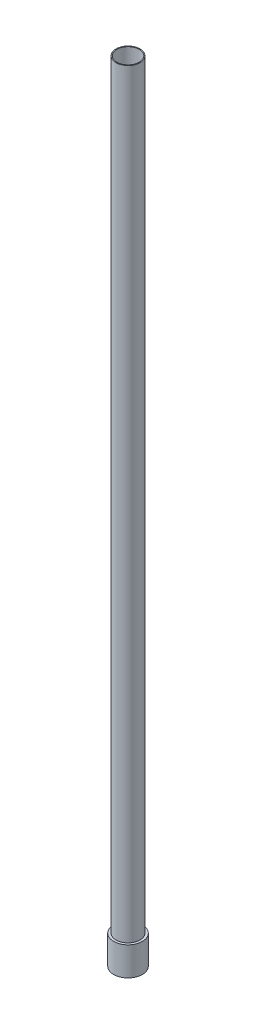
ISO-10303-21;
HEADER;
FILE_DESCRIPTION(('STEP AP214'),'2;1');
FILE_NAME('part.step','',(''),(''),'','','');
FILE_SCHEMA(('AUTOMOTIVE_DESIGN { 1 0 10303 214 1 1 1 1 }'));
ENDSEC;
DATA;
#1=APPLICATION_CONTEXT('core data for automotive mechanical design processes');
#2=APPLICATION_PROTOCOL_DEFINITION('international standard','automotive_design',2000,#1);
#3=PRODUCT_CONTEXT('',#1,'mechanical');
#4=PRODUCT('Part','Part','',(#3));
#5=PRODUCT_RELATED_PRODUCT_CATEGORY('part','',(#4));
#6=PRODUCT_DEFINITION_FORMATION('','',#4);
#7=PRODUCT_DEFINITION_CONTEXT('part definition',#1,'design');
#8=PRODUCT_DEFINITION('design','',#6,#7);
#9=PRODUCT_DEFINITION_SHAPE('','',#8);
#10=(LENGTH_UNIT() NAMED_UNIT(*) SI_UNIT(.MILLI.,.METRE.));
#11=(NAMED_UNIT(*) PLANE_ANGLE_UNIT() SI_UNIT($,.RADIAN.));
#12=(NAMED_UNIT(*) SI_UNIT($,.STERADIAN.) SOLID_ANGLE_UNIT());
#13=UNCERTAINTY_MEASURE_WITH_UNIT(LENGTH_MEASURE(1.E-05),#10,'distance_accuracy_value','');
#14=(GEOMETRIC_REPRESENTATION_CONTEXT(3) GLOBAL_UNCERTAINTY_ASSIGNED_CONTEXT((#13)) GLOBAL_UNIT_ASSIGNED_CONTEXT((#10,
#11,#12)) REPRESENTATION_CONTEXT('',''));
#15=CARTESIAN_POINT('',(0.,0.,0.));
#16=DIRECTION('',(0.,0.,1.));
#17=DIRECTION('',(1.,0.,0.));
#18=AXIS2_PLACEMENT_3D('',#15,#16,#17);
#19=CARTESIAN_POINT('',(0.,0.,0.));
#20=DIRECTION('',(0.,-1.,0.));
#21=DIRECTION('',(0.,0.,-1.));
#22=AXIS2_PLACEMENT_3D('',#19,#20,#21);
#23=CYLINDRICAL_SURFACE('',#22,4.318);
#24=CARTESIAN_POINT('',(0.,304.8,0.));
#25=DIRECTION('',(0.,-1.,0.));
#26=DIRECTION('',(0.,0.,-1.));
#27=AXIS2_PLACEMENT_3D('',#24,#25,#26);
#28=CIRCLE('',#27,4.318);
#29=CARTESIAN_POINT('',(0.,304.8,-4.318));
#30=VERTEX_POINT('',#29);
#31=EDGE_CURVE('E52',#30,#30,#28,.T.);
#32=ORIENTED_EDGE('',*,*,#31,.F.);
#33=EDGE_LOOP('',(#32));
#34=FACE_BOUND('',#33,.T.);
#35=CARTESIAN_POINT('',(0.,0.,0.));
#36=DIRECTION('',(0.,-1.,0.));
#37=DIRECTION('',(0.,0.,-1.));
#38=AXIS2_PLACEMENT_3D('',#35,#36,#37);
#39=CIRCLE('',#38,4.318);
#40=CARTESIAN_POINT('',(0.,0.,-4.318));
#41=VERTEX_POINT('',#40);
#42=EDGE_CURVE('E10',#41,#41,#39,.T.);
#43=ORIENTED_EDGE('',*,*,#42,.T.);
#44=EDGE_LOOP('',(#43));
#45=FACE_BOUND('',#44,.T.);
#46=ADVANCED_FACE('F30',(#34,#45),#23,.F.);
#47=CARTESIAN_POINT('',(-4.318,0.,0.));
#48=DIRECTION('',(0.,1.,0.));
#49=DIRECTION('',(0.,0.,1.));
#50=AXIS2_PLACEMENT_3D('',#47,#48,#49);
#51=PLANE('',#50);
#52=ORIENTED_EDGE('',*,*,#42,.F.);
#53=EDGE_LOOP('',(#52));
#54=FACE_BOUND('',#53,.T.);
#55=CARTESIAN_POINT('',(0.,0.,0.));
#56=DIRECTION('',(0.,-1.,0.));
#57=DIRECTION('',(0.,0.,-1.));
#58=AXIS2_PLACEMENT_3D('',#55,#56,#57);
#59=CIRCLE('',#58,5.5499);
#60=CARTESIAN_POINT('',(0.,0.,-5.5499));
#61=VERTEX_POINT('',#60);
#62=EDGE_CURVE('E36',#61,#61,#59,.T.);
#63=ORIENTED_EDGE('',*,*,#62,.T.);
#64=EDGE_LOOP('',(#63));
#65=FACE_BOUND('',#64,.T.);
#66=ADVANCED_FACE('F59',(#54,#65),#51,.F.);
#67=CARTESIAN_POINT('',(0.,0.,0.));
#68=DIRECTION('',(0.,-1.,0.));
#69=DIRECTION('',(0.,0.,-1.));
#70=AXIS2_PLACEMENT_3D('',#67,#68,#69);
#71=CYLINDRICAL_SURFACE('',#70,5.5499);
#72=ORIENTED_EDGE('',*,*,#62,.F.);
#73=EDGE_LOOP('',(#72));
#74=FACE_BOUND('',#73,.T.);
#75=CARTESIAN_POINT('',(0.,11.0998,0.));
#76=DIRECTION('',(0.,-1.,0.));
#77=DIRECTION('',(0.,0.,-1.));
#78=AXIS2_PLACEMENT_3D('',#75,#76,#77);
#79=CIRCLE('',#78,5.5499);
#80=CARTESIAN_POINT('',(0.,11.0998,-5.5499));
#81=VERTEX_POINT('',#80);
#82=EDGE_CURVE('E40',#81,#81,#79,.T.);
#83=ORIENTED_EDGE('',*,*,#82,.T.);
#84=EDGE_LOOP('',(#83));
#85=FACE_BOUND('',#84,.T.);
#86=ADVANCED_FACE('F63',(#74,#85),#71,.T.);
#87=CARTESIAN_POINT('',(-5.5499,11.0998,0.));
#88=DIRECTION('',(0.,-1.,0.));
#89=DIRECTION('',(0.,0.,-1.));
#90=AXIS2_PLACEMENT_3D('',#87,#88,#89);
#91=PLANE('',#90);
#92=ORIENTED_EDGE('',*,*,#82,.F.);
#93=EDGE_LOOP('',(#92));
#94=FACE_BOUND('',#93,.T.);
#95=CARTESIAN_POINT('',(0.,11.0998,0.));
#96=DIRECTION('',(0.,-1.,0.));
#97=DIRECTION('',(0.,0.,-1.));
#98=AXIS2_PLACEMENT_3D('',#95,#96,#97);
#99=CIRCLE('',#98,4.6355);
#100=CARTESIAN_POINT('',(0.,11.0998,-4.6355));
#101=VERTEX_POINT('',#100);
#102=EDGE_CURVE('E44',#101,#101,#99,.T.);
#103=ORIENTED_EDGE('',*,*,#102,.T.);
#104=EDGE_LOOP('',(#103));
#105=FACE_BOUND('',#104,.T.);
#106=ADVANCED_FACE('F68',(#94,#105),#91,.F.);
#107=CARTESIAN_POINT('',(0.,0.,0.));
#108=DIRECTION('',(0.,-1.,0.));
#109=DIRECTION('',(0.,0.,-1.));
#110=AXIS2_PLACEMENT_3D('',#107,#108,#109);
#111=CYLINDRICAL_SURFACE('',#110,4.6355);
#112=ORIENTED_EDGE('',*,*,#102,.F.);
#113=EDGE_LOOP('',(#112));
#114=FACE_BOUND('',#113,.T.);
#115=CARTESIAN_POINT('',(0.,304.8,0.));
#116=DIRECTION('',(0.,-1.,0.));
#117=DIRECTION('',(0.,0.,-1.));
#118=AXIS2_PLACEMENT_3D('',#115,#116,#117);
#119=CIRCLE('',#118,4.6355);
#120=CARTESIAN_POINT('',(0.,304.8,-4.6355));
#121=VERTEX_POINT('',#120);
#122=EDGE_CURVE('E49',#121,#121,#119,.T.);
#123=ORIENTED_EDGE('',*,*,#122,.T.);
#124=EDGE_LOOP('',(#123));
#125=FACE_BOUND('',#124,.T.);
#126=ADVANCED_FACE('F74',(#114,#125),#111,.T.);
#127=CARTESIAN_POINT('',(-4.6355,304.8,0.));
#128=DIRECTION('',(0.,-1.,0.));
#129=DIRECTION('',(0.,0.,-1.));
#130=AXIS2_PLACEMENT_3D('',#127,#128,#129);
#131=PLANE('',#130);
#132=ORIENTED_EDGE('',*,*,#122,.F.);
#133=EDGE_LOOP('',(#132));
#134=FACE_BOUND('',#133,.T.);
#135=ORIENTED_EDGE('',*,*,#31,.T.);
#136=EDGE_LOOP('',(#135));
#137=FACE_BOUND('',#136,.T.);
#138=ADVANCED_FACE('F56',(#134,#137),#131,.F.);
#139=CLOSED_SHELL('',(#46,#66,#86,#106,#126,#138));
#140=MANIFOLD_SOLID_BREP('B2',#139);
#141=ADVANCED_BREP_SHAPE_REPRESENTATION('',(#18,#140),#14);
#142=SHAPE_DEFINITION_REPRESENTATION(#9,#141);
ENDSEC;
END-ISO-10303-21;
